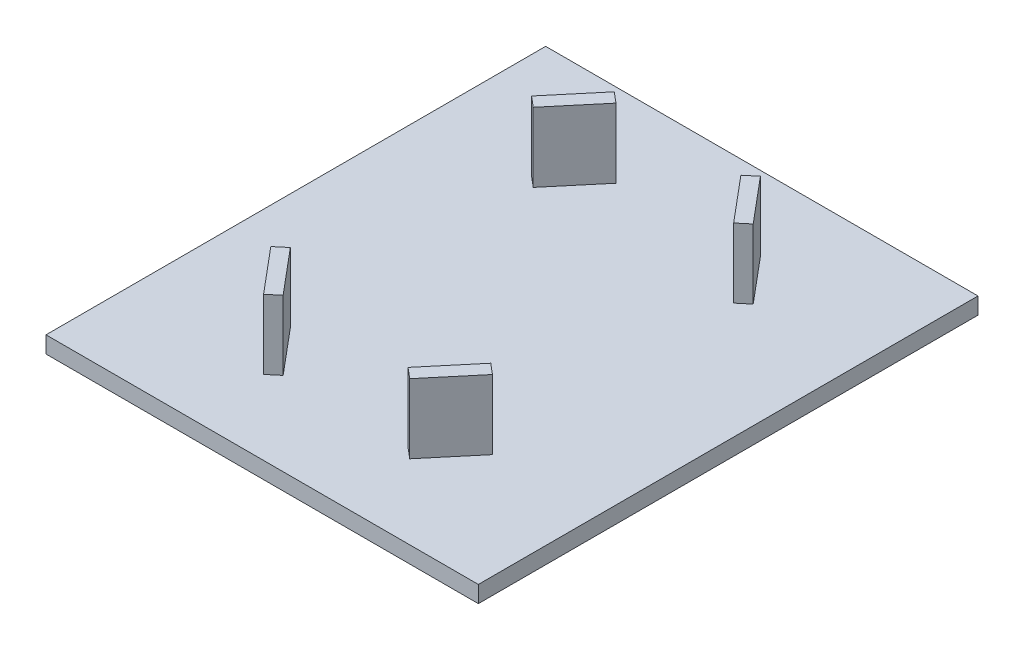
from build123d import *

# Parameters (mm, degrees)
F_12MM_THICK_DEPTH                  = 12
MOUNTING_HORIZONTAL_THRUSTERS_DEPTH = 50


with BuildPart() as part:
    # Thruster Placement Diagram → 12mm thick (new body)
    with BuildSketch(Plane(origin=(0, 0, 0), x_dir=(1, 0, 0), z_dir=(0, 1, 0))):
        Polygon((-115.75, -180), (115.75, -180), (155.75, -180), (155.75, -140), (155.75, 140), (155.75, 180), (115.75, 180), (-115.75, 180), (-155.75, 180), (-155.75, 140), (-155.75, -140), (-155.75, -180), align=None)
    extrude(amount=F_12MM_THICK_DEPTH)

    # Sketch2 → Mounting horizontal thrusters (add)
    with BuildSketch(Plane(origin=(0, 12, 0), x_dir=(1, 0, 0), z_dir=(0, 1, 0))):
        Polygon((-72.18991589, -87.5), (-79.850360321, -93.927876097), (-52.660444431, -126.331556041), (-45, -119.903679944), align=None)
        Polygon((-72.18991589, 87.5), (-45, 119.903679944), (-52.660444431, 126.331556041), (-79.850360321, 93.927876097), align=None)
        Polygon((72.18991589, -87.5), (45, -119.903679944), (52.660444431, -126.331556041), (79.850360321, -93.927876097), align=None)
        Polygon((72.18991589, 87.5), (79.850360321, 93.927876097), (52.660444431, 126.331556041), (45, 119.903679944), align=None)
    extrude(amount=MOUNTING_HORIZONTAL_THRUSTERS_DEPTH)


solid = part.part
